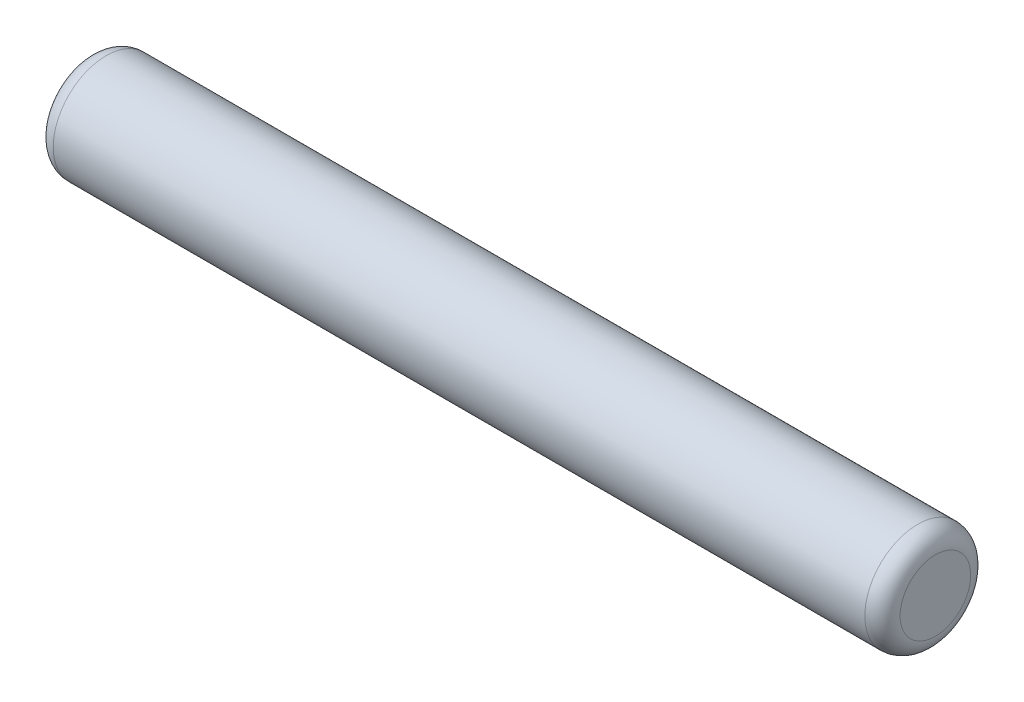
ISO-10303-21;
HEADER;
FILE_DESCRIPTION(('STEP AP214'),'2;1');
FILE_NAME('part.step','',(''),(''),'','','');
FILE_SCHEMA(('AUTOMOTIVE_DESIGN { 1 0 10303 214 1 1 1 1 }'));
ENDSEC;
DATA;
#1=APPLICATION_CONTEXT('core data for automotive mechanical design processes');
#2=APPLICATION_PROTOCOL_DEFINITION('international standard','automotive_design',2000,#1);
#3=PRODUCT_CONTEXT('',#1,'mechanical');
#4=PRODUCT('Part','Part','',(#3));
#5=PRODUCT_RELATED_PRODUCT_CATEGORY('part','',(#4));
#6=PRODUCT_DEFINITION_FORMATION('','',#4);
#7=PRODUCT_DEFINITION_CONTEXT('part definition',#1,'design');
#8=PRODUCT_DEFINITION('design','',#6,#7);
#9=PRODUCT_DEFINITION_SHAPE('','',#8);
#10=(LENGTH_UNIT() NAMED_UNIT(*) SI_UNIT(.MILLI.,.METRE.));
#11=(NAMED_UNIT(*) PLANE_ANGLE_UNIT() SI_UNIT($,.RADIAN.));
#12=(NAMED_UNIT(*) SI_UNIT($,.STERADIAN.) SOLID_ANGLE_UNIT());
#13=UNCERTAINTY_MEASURE_WITH_UNIT(LENGTH_MEASURE(1.E-05),#10,'distance_accuracy_value','');
#14=(GEOMETRIC_REPRESENTATION_CONTEXT(3) GLOBAL_UNCERTAINTY_ASSIGNED_CONTEXT((#13)) GLOBAL_UNIT_ASSIGNED_CONTEXT((#10,
#11,#12)) REPRESENTATION_CONTEXT('',''));
#15=CARTESIAN_POINT('',(0.,0.,0.));
#16=DIRECTION('',(0.,0.,1.));
#17=DIRECTION('',(1.,0.,0.));
#18=AXIS2_PLACEMENT_3D('',#15,#16,#17);
#19=CARTESIAN_POINT('',(12.,0.,0.));
#20=DIRECTION('',(-1.,0.,0.));
#21=DIRECTION('',(0.,0.,1.));
#22=AXIS2_PLACEMENT_3D('',#19,#20,#21);
#23=CYLINDRICAL_SURFACE('',#22,1.5);
#24=CARTESIAN_POINT('',(-11.5,0.,0.));
#25=DIRECTION('',(1.,0.,0.));
#26=DIRECTION('',(0.,0.,-1.));
#27=AXIS2_PLACEMENT_3D('',#24,#25,#26);
#28=CIRCLE('',#27,1.5);
#29=CARTESIAN_POINT('',(-11.5,0.,-1.5));
#30=VERTEX_POINT('',#29);
#31=EDGE_CURVE('E40',#30,#30,#28,.T.);
#32=ORIENTED_EDGE('',*,*,#31,.T.);
#33=EDGE_LOOP('',(#32));
#34=FACE_BOUND('',#33,.T.);
#35=CARTESIAN_POINT('',(11.5,0.,0.));
#36=DIRECTION('',(1.,0.,0.));
#37=DIRECTION('',(0.,0.,-1.));
#38=AXIS2_PLACEMENT_3D('',#35,#36,#37);
#39=CIRCLE('',#38,1.5);
#40=CARTESIAN_POINT('',(11.5,0.,-1.5));
#41=VERTEX_POINT('',#40);
#42=EDGE_CURVE('E44',#41,#41,#39,.F.);
#43=ORIENTED_EDGE('',*,*,#42,.T.);
#44=EDGE_LOOP('',(#43));
#45=FACE_BOUND('',#44,.T.);
#46=ADVANCED_FACE('F29',(#34,#45),#23,.T.);
#47=CARTESIAN_POINT('',(12.,0.,0.));
#48=DIRECTION('',(1.,0.,0.));
#49=DIRECTION('',(0.,0.,-1.));
#50=AXIS2_PLACEMENT_3D('',#47,#48,#49);
#51=PLANE('',#50);
#52=CARTESIAN_POINT('',(12.,0.,0.));
#53=DIRECTION('',(1.,0.,0.));
#54=DIRECTION('',(0.,0.,-1.));
#55=AXIS2_PLACEMENT_3D('',#52,#53,#54);
#56=CIRCLE('',#55,1.);
#57=CARTESIAN_POINT('',(12.,0.,-1.));
#58=VERTEX_POINT('',#57);
#59=EDGE_CURVE('E10',#58,#58,#56,.T.);
#60=ORIENTED_EDGE('',*,*,#59,.T.);
#61=EDGE_LOOP('',(#60));
#62=FACE_BOUND('',#61,.T.);
#63=ADVANCED_FACE('F60',(#62),#51,.T.);
#64=CARTESIAN_POINT('',(-12.,0.,0.));
#65=DIRECTION('',(1.,0.,0.));
#66=DIRECTION('',(0.,0.,-1.));
#67=AXIS2_PLACEMENT_3D('',#64,#65,#66);
#68=PLANE('',#67);
#69=CARTESIAN_POINT('',(-12.,0.,0.));
#70=DIRECTION('',(1.,0.,0.));
#71=DIRECTION('',(0.,0.,-1.));
#72=AXIS2_PLACEMENT_3D('',#69,#70,#71);
#73=CIRCLE('',#72,1.);
#74=CARTESIAN_POINT('',(-12.,0.,-1.));
#75=VERTEX_POINT('',#74);
#76=EDGE_CURVE('E36',#75,#75,#73,.F.);
#77=ORIENTED_EDGE('',*,*,#76,.T.);
#78=EDGE_LOOP('',(#77));
#79=FACE_BOUND('',#78,.T.);
#80=ADVANCED_FACE('F57',(#79),#68,.F.);
#81=CARTESIAN_POINT('',(-11.5,0.,0.));
#82=DIRECTION('',(1.,0.,0.));
#83=DIRECTION('',(0.,0.,-1.));
#84=AXIS2_PLACEMENT_3D('',#81,#82,#83);
#85=TOROIDAL_SURFACE('',#84,1.,0.5);
#86=ORIENTED_EDGE('',*,*,#76,.F.);
#87=EDGE_LOOP('',(#86));
#88=FACE_BOUND('',#87,.T.);
#89=ORIENTED_EDGE('',*,*,#31,.F.);
#90=EDGE_LOOP('',(#89));
#91=FACE_BOUND('',#90,.T.);
#92=ADVANCED_FACE('F53',(#88,#91),#85,.T.);
#93=CARTESIAN_POINT('',(11.5,0.,0.));
#94=DIRECTION('',(1.,0.,0.));
#95=DIRECTION('',(0.,0.,-1.));
#96=AXIS2_PLACEMENT_3D('',#93,#94,#95);
#97=TOROIDAL_SURFACE('',#96,1.,0.5);
#98=ORIENTED_EDGE('',*,*,#42,.F.);
#99=EDGE_LOOP('',(#98));
#100=FACE_BOUND('',#99,.T.);
#101=ORIENTED_EDGE('',*,*,#59,.F.);
#102=EDGE_LOOP('',(#101));
#103=FACE_BOUND('',#102,.T.);
#104=ADVANCED_FACE('F31',(#100,#103),#97,.T.);
#105=CLOSED_SHELL('',(#46,#63,#80,#92,#104));
#106=MANIFOLD_SOLID_BREP('B2',#105);
#107=ADVANCED_BREP_SHAPE_REPRESENTATION('',(#18,#106),#14);
#108=SHAPE_DEFINITION_REPRESENTATION(#9,#107);
ENDSEC;
END-ISO-10303-21;
